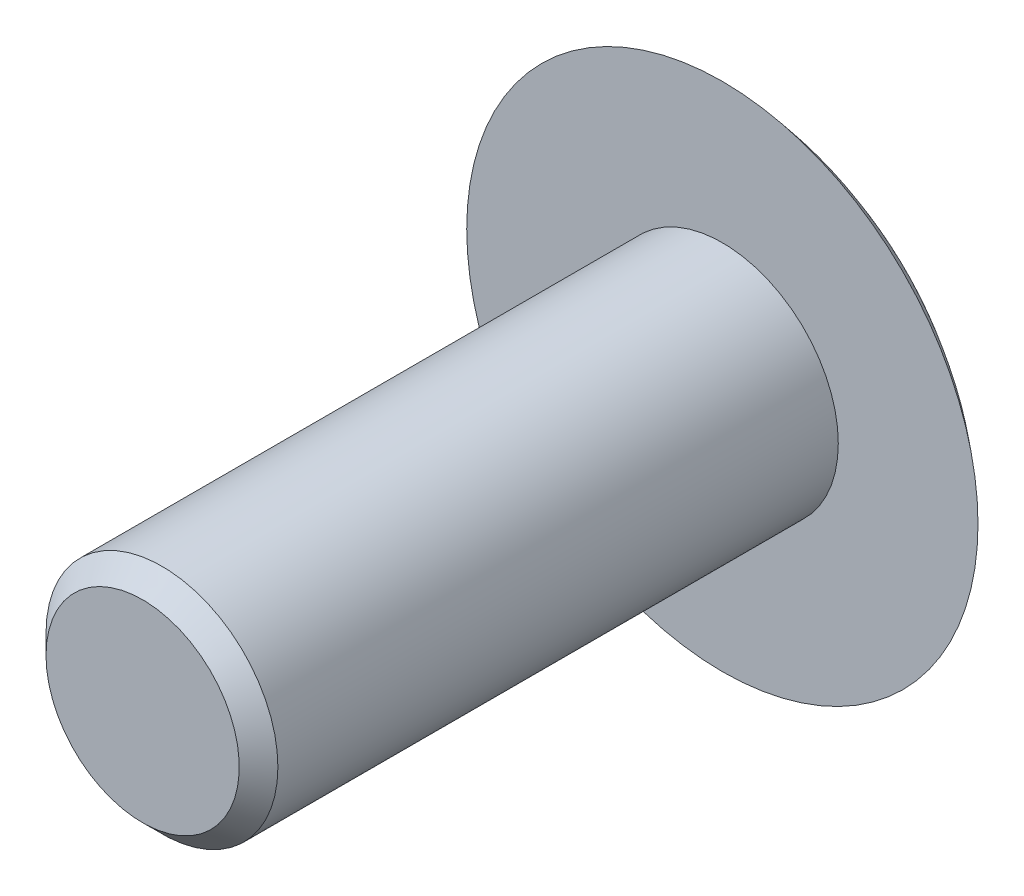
from build123d import *

# Parameters (mm, degrees)
CHANFREIN1_SIZE = 0.5


with BuildPart() as part:
    # Esquisse1 → R_volution1 (revolve)
    with BuildSketch(Plane(origin=(0, 0, 0), x_dir=(1, 0, 0), z_dir=(0, 1, 0))):
        with BuildLine():
            Line((0, 0), (0, 17.5))
            ThreePointArc((0, 17.5), (-3.535533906, 16.854143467), (-6.614378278, 15))
            Line((-6.614378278, 15), (-3, 15))
            Line((-3, 15), (-3, 0))
            Line((-3, 0), (0, 0))
        make_face()
    revolve(axis=Axis((0, 0, 0), (0, 0, -1)))

    # Chanfrein1
    chanfrein1_edges = [part.edges().sort_by_distance(p)[0] for p in [
        (3, 0, 0),
    ]]
    chamfer(chanfrein1_edges, length=CHANFREIN1_SIZE)


solid = part.part
